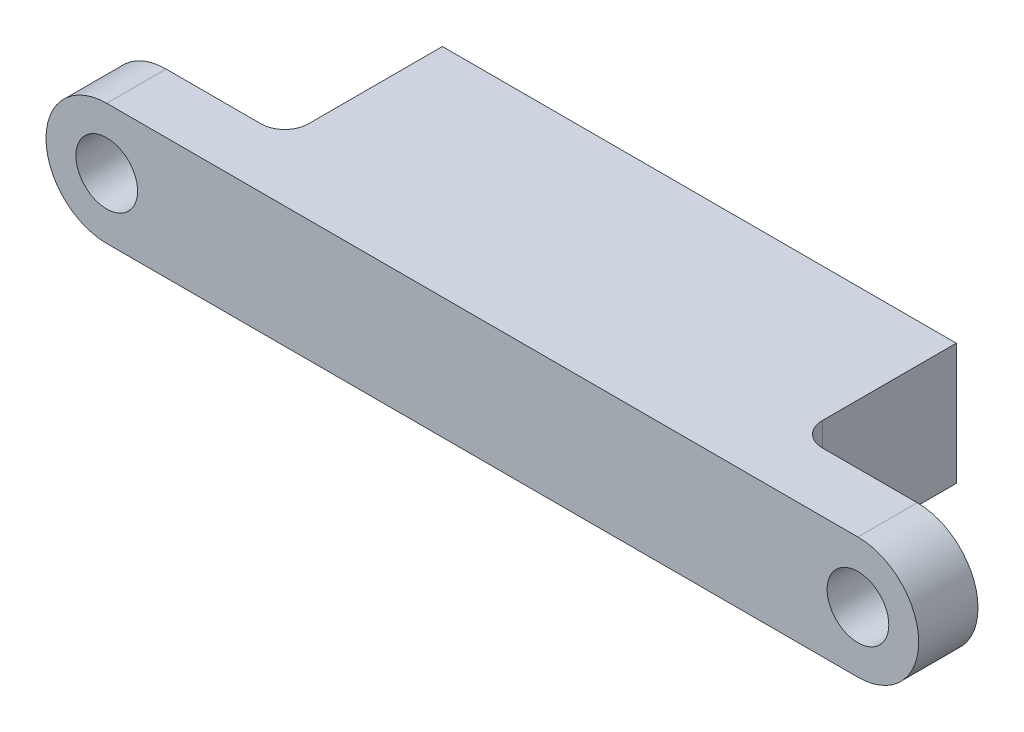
ISO-10303-21;
HEADER;
FILE_DESCRIPTION(('STEP AP214'),'2;1');
FILE_NAME('part.step','',(''),(''),'','','');
FILE_SCHEMA(('AUTOMOTIVE_DESIGN { 1 0 10303 214 1 1 1 1 }'));
ENDSEC;
DATA;
#1=APPLICATION_CONTEXT('core data for automotive mechanical design processes');
#2=APPLICATION_PROTOCOL_DEFINITION('international standard','automotive_design',2000,#1);
#3=PRODUCT_CONTEXT('',#1,'mechanical');
#4=PRODUCT('Part','Part','',(#3));
#5=PRODUCT_RELATED_PRODUCT_CATEGORY('part','',(#4));
#6=PRODUCT_DEFINITION_FORMATION('','',#4);
#7=PRODUCT_DEFINITION_CONTEXT('part definition',#1,'design');
#8=PRODUCT_DEFINITION('design','',#6,#7);
#9=PRODUCT_DEFINITION_SHAPE('','',#8);
#10=(LENGTH_UNIT() NAMED_UNIT(*) SI_UNIT(.MILLI.,.METRE.));
#11=(NAMED_UNIT(*) PLANE_ANGLE_UNIT() SI_UNIT($,.RADIAN.));
#12=(NAMED_UNIT(*) SI_UNIT($,.STERADIAN.) SOLID_ANGLE_UNIT());
#13=UNCERTAINTY_MEASURE_WITH_UNIT(LENGTH_MEASURE(1.E-05),#10,'distance_accuracy_value','');
#14=(GEOMETRIC_REPRESENTATION_CONTEXT(3) GLOBAL_UNCERTAINTY_ASSIGNED_CONTEXT((#13)) GLOBAL_UNIT_ASSIGNED_CONTEXT((#10,
#11,#12)) REPRESENTATION_CONTEXT('',''));
#15=CARTESIAN_POINT('',(0.,0.,0.));
#16=DIRECTION('',(0.,0.,1.));
#17=DIRECTION('',(1.,0.,0.));
#18=AXIS2_PLACEMENT_3D('',#15,#16,#17);
#19=CARTESIAN_POINT('',(483.575693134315,1224.12016125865,1192.24754986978));
#20=DIRECTION('',(0.,0.,1.));
#21=DIRECTION('',(0.,-1.,0.));
#22=AXIS2_PLACEMENT_3D('',#19,#20,#21);
#23=CYLINDRICAL_SURFACE('',#22,2.24999999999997);
#24=CARTESIAN_POINT('',(483.575693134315,1224.12016125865,1248.76303447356));
#25=DIRECTION('',(0.,0.,-1.));
#26=DIRECTION('',(0.,1.,0.));
#27=AXIS2_PLACEMENT_3D('',#24,#25,#26);
#28=CIRCLE('',#27,2.24999999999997);
#29=CARTESIAN_POINT('',(483.575693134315,1226.37016125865,1248.76303447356));
#30=VERTEX_POINT('',#29);
#31=EDGE_CURVE('E181',#30,#30,#28,.T.);
#32=ORIENTED_EDGE('',*,*,#31,.T.);
#33=EDGE_LOOP('',(#32));
#34=FACE_BOUND('',#33,.T.);
#35=CARTESIAN_POINT('',(483.575693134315,1224.12016125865,1248.87403447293));
#36=DIRECTION('',(0.,0.,1.));
#37=DIRECTION('',(1.,0.,0.));
#38=AXIS2_PLACEMENT_3D('',#35,#36,#37);
#39=CIRCLE('',#38,2.24999999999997);
#40=CARTESIAN_POINT('',(485.825693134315,1224.12016125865,1248.87403447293));
#41=VERTEX_POINT('',#40);
#42=EDGE_CURVE('E126',#41,#41,#39,.T.);
#43=ORIENTED_EDGE('',*,*,#42,.T.);
#44=EDGE_LOOP('',(#43));
#45=FACE_BOUND('',#44,.T.);
#46=ADVANCED_FACE('F39',(#34,#45),#23,.F.);
#47=CARTESIAN_POINT('',(441.575693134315,1224.12016125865,1192.24754986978));
#48=DIRECTION('',(0.,0.,1.));
#49=DIRECTION('',(0.,-1.,0.));
#50=AXIS2_PLACEMENT_3D('',#47,#48,#49);
#51=CYLINDRICAL_SURFACE('',#50,2.24999999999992);
#52=CARTESIAN_POINT('',(441.575693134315,1224.12016125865,1248.76303447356));
#53=DIRECTION('',(0.,0.,-1.));
#54=DIRECTION('',(0.,1.,0.));
#55=AXIS2_PLACEMENT_3D('',#52,#53,#54);
#56=CIRCLE('',#55,2.24999999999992);
#57=CARTESIAN_POINT('',(441.575693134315,1226.37016125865,1248.76303447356));
#58=VERTEX_POINT('',#57);
#59=EDGE_CURVE('E157',#58,#58,#56,.T.);
#60=ORIENTED_EDGE('',*,*,#59,.T.);
#61=EDGE_LOOP('',(#60));
#62=FACE_BOUND('',#61,.T.);
#63=CARTESIAN_POINT('',(441.575693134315,1224.12016125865,1248.87403447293));
#64=DIRECTION('',(0.,0.,1.));
#65=DIRECTION('',(1.,0.,0.));
#66=AXIS2_PLACEMENT_3D('',#63,#64,#65);
#67=CIRCLE('',#66,2.24999999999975);
#68=CARTESIAN_POINT('',(443.825693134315,1224.12016125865,1248.87403447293));
#69=VERTEX_POINT('',#68);
#70=EDGE_CURVE('E128',#69,#69,#67,.T.);
#71=ORIENTED_EDGE('',*,*,#70,.T.);
#72=EDGE_LOOP('',(#71));
#73=FACE_BOUND('',#72,.T.);
#74=ADVANCED_FACE('F281',(#62,#73),#51,.F.);
#75=CARTESIAN_POINT('',(490.075693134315,1230.62016125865,1192.24754986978));
#76=DIRECTION('',(0.,-1.,0.));
#77=DIRECTION('',(0.,0.,-1.));
#78=AXIS2_PLACEMENT_3D('',#75,#76,#77);
#79=PLANE('',#78);
#80=DIRECTION('',(1.,0.,0.));
#81=VECTOR('',#80,1.);
#82=CARTESIAN_POINT('',(490.075693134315,1230.62016125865,1248.76303447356));
#83=LINE('',#82,#81);
#84=CARTESIAN_POINT('',(435.075693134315,1230.62016125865,1248.76303447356));
#85=VERTEX_POINT('',#84);
#86=CARTESIAN_POINT('',(490.075693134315,1230.62016125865,1248.76303447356));
#87=VERTEX_POINT('',#86);
#88=EDGE_CURVE('E186',#85,#87,#83,.T.);
#89=ORIENTED_EDGE('',*,*,#88,.F.);
#90=DIRECTION('',(0.,0.,1.));
#91=VECTOR('',#90,1.);
#92=CARTESIAN_POINT('',(435.075693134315,1230.62016125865,1192.24754986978));
#93=LINE('',#92,#91);
#94=CARTESIAN_POINT('',(435.075693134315,1230.62016125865,1263.09803447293));
#95=VERTEX_POINT('',#94);
#96=EDGE_CURVE('E202',#85,#95,#93,.T.);
#97=ORIENTED_EDGE('',*,*,#96,.T.);
#98=CARTESIAN_POINT('',(432.535693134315,1230.62016125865,1263.09803447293));
#99=DIRECTION('',(0.,-1.,0.));
#100=DIRECTION('',(0.,0.,-1.));
#101=AXIS2_PLACEMENT_3D('',#98,#99,#100);
#102=CIRCLE('',#101,2.54);
#103=CARTESIAN_POINT('',(432.535693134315,1230.62016125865,1265.63803447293));
#104=VERTEX_POINT('',#103);
#105=EDGE_CURVE('E48',#95,#104,#102,.T.);
#106=ORIENTED_EDGE('',*,*,#105,.T.);
#107=DIRECTION('',(-1.,0.,0.));
#108=VECTOR('',#107,1.);
#109=CARTESIAN_POINT('',(422.375693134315,1230.62016125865,1265.63803447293));
#110=LINE('',#109,#108);
#111=CARTESIAN_POINT('',(422.375693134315,1230.62016125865,1265.63803447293));
#112=VERTEX_POINT('',#111);
#113=EDGE_CURVE('E148',#104,#112,#110,.T.);
#114=ORIENTED_EDGE('',*,*,#113,.T.);
#115=DIRECTION('',(0.,0.,1.));
#116=VECTOR('',#115,1.);
#117=CARTESIAN_POINT('',(422.375693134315,1230.62016125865,1265.63803447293));
#118=LINE('',#117,#116);
#119=CARTESIAN_POINT('',(422.375693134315,1230.62016125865,1271.98803447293));
#120=VERTEX_POINT('',#119);
#121=EDGE_CURVE('E153',#112,#120,#118,.T.);
#122=ORIENTED_EDGE('',*,*,#121,.T.);
#123=DIRECTION('',(1.,0.,0.));
#124=VECTOR('',#123,1.);
#125=CARTESIAN_POINT('',(490.075693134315,1230.62016125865,1271.98803447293));
#126=LINE('',#125,#124);
#127=CARTESIAN_POINT('',(502.775693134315,1230.62016125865,1271.98803447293));
#128=VERTEX_POINT('',#127);
#129=EDGE_CURVE('E199',#120,#128,#126,.T.);
#130=ORIENTED_EDGE('',*,*,#129,.T.);
#131=DIRECTION('',(0.,0.,1.));
#132=VECTOR('',#131,1.);
#133=CARTESIAN_POINT('',(502.775693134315,1230.62016125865,1265.63803447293));
#134=LINE('',#133,#132);
#135=CARTESIAN_POINT('',(502.775693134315,1230.62016125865,1265.63803447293));
#136=VERTEX_POINT('',#135);
#137=EDGE_CURVE('E165',#136,#128,#134,.T.);
#138=ORIENTED_EDGE('',*,*,#137,.F.);
#139=DIRECTION('',(-1.,0.,0.));
#140=VECTOR('',#139,1.);
#141=CARTESIAN_POINT('',(502.775693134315,1230.62016125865,1265.63803447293));
#142=LINE('',#141,#140);
#143=CARTESIAN_POINT('',(492.615693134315,1230.62016125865,1265.63803447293));
#144=VERTEX_POINT('',#143);
#145=EDGE_CURVE('E173',#136,#144,#142,.T.);
#146=ORIENTED_EDGE('',*,*,#145,.T.);
#147=CARTESIAN_POINT('',(492.615693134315,1230.62016125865,1263.09803447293));
#148=DIRECTION('',(0.,-1.,0.));
#149=DIRECTION('',(0.,0.,-1.));
#150=AXIS2_PLACEMENT_3D('',#147,#148,#149);
#151=CIRCLE('',#150,2.54);
#152=CARTESIAN_POINT('',(490.075693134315,1230.62016125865,1263.09803447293));
#153=VERTEX_POINT('',#152);
#154=EDGE_CURVE('E226',#144,#153,#151,.T.);
#155=ORIENTED_EDGE('',*,*,#154,.T.);
#156=DIRECTION('',(0.,0.,1.));
#157=VECTOR('',#156,1.);
#158=CARTESIAN_POINT('',(490.075693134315,1230.62016125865,1192.24754986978));
#159=LINE('',#158,#157);
#160=EDGE_CURVE('E205',#87,#153,#159,.T.);
#161=ORIENTED_EDGE('',*,*,#160,.F.);
#162=EDGE_LOOP('',(#89,#97,#106,#114,#122,#130,#138,#146,#155,#161));
#163=FACE_BOUND('',#162,.T.);
#164=ADVANCED_FACE('F230',(#163),#79,.F.);
#165=CARTESIAN_POINT('',(435.075693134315,1230.62016125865,1192.24754986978));
#166=DIRECTION('',(1.,0.,0.));
#167=DIRECTION('',(0.,0.,-1.));
#168=AXIS2_PLACEMENT_3D('',#165,#166,#167);
#169=PLANE('',#168);
#170=DIRECTION('',(0.,0.,1.));
#171=VECTOR('',#170,1.);
#172=CARTESIAN_POINT('',(435.075693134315,1217.62016125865,1192.24754986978));
#173=LINE('',#172,#171);
#174=CARTESIAN_POINT('',(435.075693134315,1217.62016125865,1248.76303447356));
#175=VERTEX_POINT('',#174);
#176=CARTESIAN_POINT('',(435.075693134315,1217.62016125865,1263.09803447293));
#177=VERTEX_POINT('',#176);
#178=EDGE_CURVE('E210',#175,#177,#173,.T.);
#179=ORIENTED_EDGE('',*,*,#178,.T.);
#180=DIRECTION('',(0.,1.,0.));
#181=VECTOR('',#180,1.);
#182=CARTESIAN_POINT('',(435.075693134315,1230.62016125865,1263.09803447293));
#183=LINE('',#182,#181);
#184=EDGE_CURVE('E219',#177,#95,#183,.T.);
#185=ORIENTED_EDGE('',*,*,#184,.T.);
#186=ORIENTED_EDGE('',*,*,#96,.F.);
#187=DIRECTION('',(0.,1.,0.));
#188=VECTOR('',#187,1.);
#189=CARTESIAN_POINT('',(435.075693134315,1230.62016125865,1248.76303447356));
#190=LINE('',#189,#188);
#191=EDGE_CURVE('E188',#175,#85,#190,.T.);
#192=ORIENTED_EDGE('',*,*,#191,.F.);
#193=EDGE_LOOP('',(#179,#185,#186,#192));
#194=FACE_BOUND('',#193,.T.);
#195=ADVANCED_FACE('F262',(#194),#169,.F.);
#196=CARTESIAN_POINT('',(490.075693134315,1217.62016125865,1192.24754986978));
#197=DIRECTION('',(0.,1.,0.));
#198=DIRECTION('',(0.,0.,1.));
#199=AXIS2_PLACEMENT_3D('',#196,#197,#198);
#200=PLANE('',#199);
#201=DIRECTION('',(-1.,0.,0.));
#202=VECTOR('',#201,1.);
#203=CARTESIAN_POINT('',(490.075693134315,1217.62016125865,1248.76303447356));
#204=LINE('',#203,#202);
#205=CARTESIAN_POINT('',(490.075693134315,1217.62016125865,1248.76303447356));
#206=VERTEX_POINT('',#205);
#207=EDGE_CURVE('E195',#206,#175,#204,.T.);
#208=ORIENTED_EDGE('',*,*,#207,.F.);
#209=DIRECTION('',(0.,0.,1.));
#210=VECTOR('',#209,1.);
#211=CARTESIAN_POINT('',(490.075693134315,1217.62016125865,1192.24754986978));
#212=LINE('',#211,#210);
#213=CARTESIAN_POINT('',(490.075693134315,1217.62016125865,1263.09803447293));
#214=VERTEX_POINT('',#213);
#215=EDGE_CURVE('E209',#206,#214,#212,.T.);
#216=ORIENTED_EDGE('',*,*,#215,.T.);
#217=CARTESIAN_POINT('',(492.615693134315,1217.62016125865,1263.09803447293));
#218=DIRECTION('',(0.,1.,0.));
#219=DIRECTION('',(0.,0.,1.));
#220=AXIS2_PLACEMENT_3D('',#217,#218,#219);
#221=CIRCLE('',#220,2.54);
#222=CARTESIAN_POINT('',(492.615693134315,1217.62016125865,1265.63803447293));
#223=VERTEX_POINT('',#222);
#224=EDGE_CURVE('E221',#214,#223,#221,.T.);
#225=ORIENTED_EDGE('',*,*,#224,.T.);
#226=DIRECTION('',(1.,0.,0.));
#227=VECTOR('',#226,1.);
#228=CARTESIAN_POINT('',(490.075693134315,1217.62016125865,1265.63803447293));
#229=LINE('',#228,#227);
#230=CARTESIAN_POINT('',(502.775693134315,1217.62016125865,1265.63803447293));
#231=VERTEX_POINT('',#230);
#232=EDGE_CURVE('E164',#223,#231,#229,.T.);
#233=ORIENTED_EDGE('',*,*,#232,.T.);
#234=DIRECTION('',(0.,0.,1.));
#235=VECTOR('',#234,1.);
#236=CARTESIAN_POINT('',(502.775693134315,1217.62016125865,1265.63803447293));
#237=LINE('',#236,#235);
#238=CARTESIAN_POINT('',(502.775693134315,1217.62016125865,1271.98803447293));
#239=VERTEX_POINT('',#238);
#240=EDGE_CURVE('E135',#231,#239,#237,.T.);
#241=ORIENTED_EDGE('',*,*,#240,.T.);
#242=DIRECTION('',(-1.,0.,0.));
#243=VECTOR('',#242,1.);
#244=CARTESIAN_POINT('',(490.075693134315,1217.62016125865,1271.98803447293));
#245=LINE('',#244,#243);
#246=CARTESIAN_POINT('',(422.375693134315,1217.62016125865,1271.98803447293));
#247=VERTEX_POINT('',#246);
#248=EDGE_CURVE('E196',#239,#247,#245,.T.);
#249=ORIENTED_EDGE('',*,*,#248,.T.);
#250=DIRECTION('',(0.,0.,1.));
#251=VECTOR('',#250,1.);
#252=CARTESIAN_POINT('',(422.375693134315,1217.62016125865,1265.63803447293));
#253=LINE('',#252,#251);
#254=CARTESIAN_POINT('',(422.375693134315,1217.62016125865,1265.63803447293));
#255=VERTEX_POINT('',#254);
#256=EDGE_CURVE('E156',#255,#247,#253,.T.);
#257=ORIENTED_EDGE('',*,*,#256,.F.);
#258=DIRECTION('',(1.,0.,0.));
#259=VECTOR('',#258,1.);
#260=CARTESIAN_POINT('',(435.075693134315,1217.62016125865,1265.63803447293));
#261=LINE('',#260,#259);
#262=CARTESIAN_POINT('',(432.535693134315,1217.62016125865,1265.63803447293));
#263=VERTEX_POINT('',#262);
#264=EDGE_CURVE('E151',#255,#263,#261,.T.);
#265=ORIENTED_EDGE('',*,*,#264,.T.);
#266=CARTESIAN_POINT('',(432.535693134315,1217.62016125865,1263.09803447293));
#267=DIRECTION('',(0.,1.,0.));
#268=DIRECTION('',(0.,0.,1.));
#269=AXIS2_PLACEMENT_3D('',#266,#267,#268);
#270=CIRCLE('',#269,2.54);
#271=EDGE_CURVE('E11',#263,#177,#270,.T.);
#272=ORIENTED_EDGE('',*,*,#271,.T.);
#273=ORIENTED_EDGE('',*,*,#178,.F.);
#274=EDGE_LOOP('',(#208,#216,#225,#233,#241,#249,#257,#265,#272,#273));
#275=FACE_BOUND('',#274,.T.);
#276=ADVANCED_FACE('F242',(#275),#200,.F.);
#277=CARTESIAN_POINT('',(490.075693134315,1230.62016125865,1192.24754986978));
#278=DIRECTION('',(-1.,0.,0.));
#279=DIRECTION('',(0.,0.,1.));
#280=AXIS2_PLACEMENT_3D('',#277,#278,#279);
#281=PLANE('',#280);
#282=ORIENTED_EDGE('',*,*,#160,.T.);
#283=DIRECTION('',(0.,-1.,0.));
#284=VECTOR('',#283,1.);
#285=CARTESIAN_POINT('',(490.075693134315,1230.62016125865,1263.09803447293));
#286=LINE('',#285,#284);
#287=EDGE_CURVE('E213',#153,#214,#286,.T.);
#288=ORIENTED_EDGE('',*,*,#287,.T.);
#289=ORIENTED_EDGE('',*,*,#215,.F.);
#290=DIRECTION('',(0.,-1.,0.));
#291=VECTOR('',#290,1.);
#292=CARTESIAN_POINT('',(490.075693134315,1230.62016125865,1248.76303447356));
#293=LINE('',#292,#291);
#294=EDGE_CURVE('E192',#87,#206,#293,.T.);
#295=ORIENTED_EDGE('',*,*,#294,.F.);
#296=EDGE_LOOP('',(#282,#288,#289,#295));
#297=FACE_BOUND('',#296,.T.);
#298=ADVANCED_FACE('F240',(#297),#281,.F.);
#299=CARTESIAN_POINT('',(0.,0.,1271.98803447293));
#300=DIRECTION('',(0.,0.,-1.));
#301=DIRECTION('',(-1.,0.,0.));
#302=AXIS2_PLACEMENT_3D('',#299,#300,#301);
#303=PLANE('',#302);
#304=ORIENTED_EDGE('',*,*,#248,.F.);
#305=CARTESIAN_POINT('',(502.775693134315,1224.12016125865,1271.98803447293));
#306=DIRECTION('',(0.,0.,1.));
#307=DIRECTION('',(-1.,0.,0.));
#308=AXIS2_PLACEMENT_3D('',#305,#306,#307);
#309=CIRCLE('',#308,6.49999999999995);
#310=EDGE_CURVE('E169',#239,#128,#309,.T.);
#311=ORIENTED_EDGE('',*,*,#310,.T.);
#312=ORIENTED_EDGE('',*,*,#129,.F.);
#313=CARTESIAN_POINT('',(422.375693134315,1224.12016125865,1271.98803447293));
#314=DIRECTION('',(0.,0.,1.));
#315=DIRECTION('',(1.,0.,0.));
#316=AXIS2_PLACEMENT_3D('',#313,#314,#315);
#317=CIRCLE('',#316,6.49999999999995);
#318=EDGE_CURVE('E143',#120,#247,#317,.T.);
#319=ORIENTED_EDGE('',*,*,#318,.T.);
#320=EDGE_LOOP('',(#304,#311,#312,#319));
#321=FACE_BOUND('',#320,.T.);
#322=CARTESIAN_POINT('',(502.775693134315,1224.12016125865,1271.98803447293));
#323=DIRECTION('',(0.,0.,1.));
#324=DIRECTION('',(1.,0.,0.));
#325=AXIS2_PLACEMENT_3D('',#322,#323,#324);
#326=CIRCLE('',#325,3.30200000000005);
#327=CARTESIAN_POINT('',(506.077693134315,1224.12016125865,1271.98803447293));
#328=VERTEX_POINT('',#327);
#329=EDGE_CURVE('E144',#328,#328,#326,.T.);
#330=ORIENTED_EDGE('',*,*,#329,.F.);
#331=EDGE_LOOP('',(#330));
#332=FACE_BOUND('',#331,.T.);
#333=CARTESIAN_POINT('',(422.375693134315,1224.12016125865,1271.98803447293));
#334=DIRECTION('',(0.,0.,1.));
#335=DIRECTION('',(1.,0.,0.));
#336=AXIS2_PLACEMENT_3D('',#333,#334,#335);
#337=CIRCLE('',#336,3.30200000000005);
#338=CARTESIAN_POINT('',(425.677693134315,1224.12016125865,1271.98803447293));
#339=VERTEX_POINT('',#338);
#340=EDGE_CURVE('E142',#339,#339,#337,.T.);
#341=ORIENTED_EDGE('',*,*,#340,.F.);
#342=EDGE_LOOP('',(#341));
#343=FACE_BOUND('',#342,.T.);
#344=ADVANCED_FACE('F258',(#321,#332,#343),#303,.F.);
#345=CARTESIAN_POINT('',(573.960693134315,1001.42936125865,1248.76303447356));
#346=DIRECTION('',(0.,0.,-1.));
#347=DIRECTION('',(0.,1.,0.));
#348=AXIS2_PLACEMENT_3D('',#345,#346,#347);
#349=PLANE('',#348);
#350=ORIENTED_EDGE('',*,*,#59,.F.);
#351=EDGE_LOOP('',(#350));
#352=FACE_BOUND('',#351,.T.);
#353=ORIENTED_EDGE('',*,*,#31,.F.);
#354=EDGE_LOOP('',(#353));
#355=FACE_BOUND('',#354,.T.);
#356=ORIENTED_EDGE('',*,*,#88,.T.);
#357=ORIENTED_EDGE('',*,*,#294,.T.);
#358=ORIENTED_EDGE('',*,*,#207,.T.);
#359=ORIENTED_EDGE('',*,*,#191,.T.);
#360=EDGE_LOOP('',(#356,#357,#358,#359));
#361=FACE_BOUND('',#360,.T.);
#362=ADVANCED_FACE('F266',(#352,#355,#361),#349,.T.);
#363=CARTESIAN_POINT('',(502.775693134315,1224.12016125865,1265.63803447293));
#364=DIRECTION('',(0.,0.,1.));
#365=DIRECTION('',(1.,0.,0.));
#366=AXIS2_PLACEMENT_3D('',#363,#364,#365);
#367=CYLINDRICAL_SURFACE('',#366,6.49999999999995);
#368=ORIENTED_EDGE('',*,*,#310,.F.);
#369=ORIENTED_EDGE('',*,*,#240,.F.);
#370=CARTESIAN_POINT('',(502.775693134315,1224.12016125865,1265.63803447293));
#371=DIRECTION('',(0.,0.,1.));
#372=DIRECTION('',(-1.,0.,0.));
#373=AXIS2_PLACEMENT_3D('',#370,#371,#372);
#374=CIRCLE('',#373,6.49999999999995);
#375=EDGE_CURVE('E172',#231,#136,#374,.T.);
#376=ORIENTED_EDGE('',*,*,#375,.T.);
#377=ORIENTED_EDGE('',*,*,#137,.T.);
#378=EDGE_LOOP('',(#368,#369,#376,#377));
#379=FACE_BOUND('',#378,.T.);
#380=ADVANCED_FACE('F249',(#379),#367,.T.);
#381=CARTESIAN_POINT('',(502.775693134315,1224.12016125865,1265.63803447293));
#382=DIRECTION('',(0.,0.,-1.));
#383=DIRECTION('',(-1.,0.,0.));
#384=AXIS2_PLACEMENT_3D('',#381,#382,#383);
#385=PLANE('',#384);
#386=CARTESIAN_POINT('',(502.775693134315,1224.12016125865,1265.63803447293));
#387=DIRECTION('',(0.,0.,1.));
#388=DIRECTION('',(1.,0.,0.));
#389=AXIS2_PLACEMENT_3D('',#386,#387,#388);
#390=CIRCLE('',#389,3.30200000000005);
#391=CARTESIAN_POINT('',(506.077693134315,1224.12016125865,1265.63803447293));
#392=VERTEX_POINT('',#391);
#393=EDGE_CURVE('E171',#392,#392,#390,.T.);
#394=ORIENTED_EDGE('',*,*,#393,.T.);
#395=EDGE_LOOP('',(#394));
#396=FACE_BOUND('',#395,.T.);
#397=ORIENTED_EDGE('',*,*,#232,.F.);
#398=DIRECTION('',(0.,-1.,0.));
#399=VECTOR('',#398,1.);
#400=CARTESIAN_POINT('',(492.615693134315,1224.12016125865,1265.63803447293));
#401=LINE('',#400,#399);
#402=EDGE_CURVE('E217',#223,#144,#401,.F.);
#403=ORIENTED_EDGE('',*,*,#402,.T.);
#404=ORIENTED_EDGE('',*,*,#145,.F.);
#405=ORIENTED_EDGE('',*,*,#375,.F.);
#406=EDGE_LOOP('',(#397,#403,#404,#405));
#407=FACE_BOUND('',#406,.T.);
#408=ADVANCED_FACE('F248',(#396,#407),#385,.T.);
#409=CARTESIAN_POINT('',(502.775693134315,1224.12016125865,1265.63803447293));
#410=DIRECTION('',(0.,0.,1.));
#411=DIRECTION('',(1.,0.,0.));
#412=AXIS2_PLACEMENT_3D('',#409,#410,#411);
#413=CYLINDRICAL_SURFACE('',#412,3.30200000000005);
#414=ORIENTED_EDGE('',*,*,#393,.F.);
#415=EDGE_LOOP('',(#414));
#416=FACE_BOUND('',#415,.T.);
#417=ORIENTED_EDGE('',*,*,#329,.T.);
#418=EDGE_LOOP('',(#417));
#419=FACE_BOUND('',#418,.T.);
#420=ADVANCED_FACE('F316',(#416,#419),#413,.F.);
#421=CARTESIAN_POINT('',(422.375693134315,1224.12016125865,1265.63803447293));
#422=DIRECTION('',(0.,0.,1.));
#423=DIRECTION('',(1.,0.,0.));
#424=AXIS2_PLACEMENT_3D('',#421,#422,#423);
#425=CYLINDRICAL_SURFACE('',#424,6.49999999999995);
#426=ORIENTED_EDGE('',*,*,#318,.F.);
#427=ORIENTED_EDGE('',*,*,#121,.F.);
#428=CARTESIAN_POINT('',(422.375693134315,1224.12016125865,1265.63803447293));
#429=DIRECTION('',(0.,0.,1.));
#430=DIRECTION('',(1.,0.,0.));
#431=AXIS2_PLACEMENT_3D('',#428,#429,#430);
#432=CIRCLE('',#431,6.49999999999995);
#433=EDGE_CURVE('E146',#112,#255,#432,.T.);
#434=ORIENTED_EDGE('',*,*,#433,.T.);
#435=ORIENTED_EDGE('',*,*,#256,.T.);
#436=EDGE_LOOP('',(#426,#427,#434,#435));
#437=FACE_BOUND('',#436,.T.);
#438=ADVANCED_FACE('F251',(#437),#425,.T.);
#439=CARTESIAN_POINT('',(422.375693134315,1224.12016125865,1265.63803447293));
#440=DIRECTION('',(0.,0.,1.));
#441=DIRECTION('',(1.,0.,0.));
#442=AXIS2_PLACEMENT_3D('',#439,#440,#441);
#443=PLANE('',#442);
#444=CARTESIAN_POINT('',(422.375693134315,1224.12016125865,1265.63803447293));
#445=DIRECTION('',(0.,0.,1.));
#446=DIRECTION('',(1.,0.,0.));
#447=AXIS2_PLACEMENT_3D('',#444,#445,#446);
#448=CIRCLE('',#447,3.30200000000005);
#449=CARTESIAN_POINT('',(425.677693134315,1224.12016125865,1265.63803447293));
#450=VERTEX_POINT('',#449);
#451=EDGE_CURVE('E136',#450,#450,#448,.T.);
#452=ORIENTED_EDGE('',*,*,#451,.T.);
#453=EDGE_LOOP('',(#452));
#454=FACE_BOUND('',#453,.T.);
#455=ORIENTED_EDGE('',*,*,#113,.F.);
#456=DIRECTION('',(0.,1.,0.));
#457=VECTOR('',#456,1.);
#458=CARTESIAN_POINT('',(432.535693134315,1217.62016125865,1265.63803447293));
#459=LINE('',#458,#457);
#460=EDGE_CURVE('E54',#104,#263,#459,.F.);
#461=ORIENTED_EDGE('',*,*,#460,.T.);
#462=ORIENTED_EDGE('',*,*,#264,.F.);
#463=ORIENTED_EDGE('',*,*,#433,.F.);
#464=EDGE_LOOP('',(#455,#461,#462,#463));
#465=FACE_BOUND('',#464,.T.);
#466=ADVANCED_FACE('F256',(#454,#465),#443,.F.);
#467=CARTESIAN_POINT('',(422.375693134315,1224.12016125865,1265.63803447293));
#468=DIRECTION('',(0.,0.,1.));
#469=DIRECTION('',(1.,0.,0.));
#470=AXIS2_PLACEMENT_3D('',#467,#468,#469);
#471=CYLINDRICAL_SURFACE('',#470,3.30200000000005);
#472=ORIENTED_EDGE('',*,*,#451,.F.);
#473=EDGE_LOOP('',(#472));
#474=FACE_BOUND('',#473,.T.);
#475=ORIENTED_EDGE('',*,*,#340,.T.);
#476=EDGE_LOOP('',(#475));
#477=FACE_BOUND('',#476,.T.);
#478=ADVANCED_FACE('F299',(#474,#477),#471,.F.);
#479=CARTESIAN_POINT('',(492.615693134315,1230.62016125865,1263.09803447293));
#480=DIRECTION('',(0.,-1.,0.));
#481=DIRECTION('',(0.,0.,-1.));
#482=AXIS2_PLACEMENT_3D('',#479,#480,#481);
#483=CYLINDRICAL_SURFACE('',#482,2.54);
#484=ORIENTED_EDGE('',*,*,#154,.F.);
#485=ORIENTED_EDGE('',*,*,#402,.F.);
#486=ORIENTED_EDGE('',*,*,#224,.F.);
#487=ORIENTED_EDGE('',*,*,#287,.F.);
#488=EDGE_LOOP('',(#484,#485,#486,#487));
#489=FACE_BOUND('',#488,.T.);
#490=ADVANCED_FACE('F239',(#489),#483,.F.);
#491=CARTESIAN_POINT('',(432.535693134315,1230.62016125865,1263.09803447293));
#492=DIRECTION('',(0.,-1.,0.));
#493=DIRECTION('',(0.,0.,-1.));
#494=AXIS2_PLACEMENT_3D('',#491,#492,#493);
#495=CYLINDRICAL_SURFACE('',#494,2.54);
#496=ORIENTED_EDGE('',*,*,#271,.F.);
#497=ORIENTED_EDGE('',*,*,#460,.F.);
#498=ORIENTED_EDGE('',*,*,#105,.F.);
#499=ORIENTED_EDGE('',*,*,#184,.F.);
#500=EDGE_LOOP('',(#496,#497,#498,#499));
#501=FACE_BOUND('',#500,.T.);
#502=ADVANCED_FACE('F41',(#501),#495,.F.);
#503=CARTESIAN_POINT('',(441.575693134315,1224.12016125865,1248.87403447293));
#504=DIRECTION('',(0.,0.,1.));
#505=DIRECTION('',(1.,0.,0.));
#506=AXIS2_PLACEMENT_3D('',#503,#504,#505);
#507=PLANE('',#506);
#508=CARTESIAN_POINT('',(441.575693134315,1224.12016125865,1248.87403447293));
#509=DIRECTION('',(0.,0.,1.));
#510=DIRECTION('',(1.,0.,0.));
#511=AXIS2_PLACEMENT_3D('',#508,#509,#510);
#512=CIRCLE('',#511,2.09267716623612);
#513=CARTESIAN_POINT('',(443.668370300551,1224.12016125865,1248.87403447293));
#514=VERTEX_POINT('',#513);
#515=EDGE_CURVE('E43',#514,#514,#512,.T.);
#516=ORIENTED_EDGE('',*,*,#515,.T.);
#517=EDGE_LOOP('',(#516));
#518=FACE_BOUND('',#517,.T.);
#519=ORIENTED_EDGE('',*,*,#70,.F.);
#520=EDGE_LOOP('',(#519));
#521=FACE_BOUND('',#520,.T.);
#522=ADVANCED_FACE('F305',(#518,#521),#507,.F.);
#523=CARTESIAN_POINT('',(483.575693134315,1224.12016125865,1250.46153447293));
#524=DIRECTION('',(0.,0.,-1.));
#525=DIRECTION('',(-1.,0.,0.));
#526=AXIS2_PLACEMENT_3D('',#523,#524,#525);
#527=CONICAL_SURFACE('',#526,0.,0.956351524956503);
#528=ORIENTED_EDGE('',*,*,#42,.F.);
#529=EDGE_LOOP('',(#528));
#530=FACE_BOUND('',#529,.T.);
#531=CARTESIAN_POINT('',(483.575693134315,1224.12016125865,1250.46153447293));
#532=VERTEX_POINT('',#531);
#533=VERTEX_LOOP('',#532);
#534=FACE_BOUND('',#533,.T.);
#535=ADVANCED_FACE('F121',(#530,#534),#527,.F.);
#536=CARTESIAN_POINT('',(441.575693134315,1224.12016125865,1250.35053447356));
#537=DIRECTION('',(0.,0.,-1.));
#538=DIRECTION('',(-1.,0.,0.));
#539=AXIS2_PLACEMENT_3D('',#536,#537,#538);
#540=CONICAL_SURFACE('',#539,0.,0.95635152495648);
#541=CARTESIAN_POINT('',(441.575693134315,1224.12016125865,1250.35053447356));
#542=VERTEX_POINT('',#541);
#543=VERTEX_LOOP('',#542);
#544=FACE_BOUND('',#543,.T.);
#545=ORIENTED_EDGE('',*,*,#515,.F.);
#546=EDGE_LOOP('',(#545));
#547=FACE_BOUND('',#546,.T.);
#548=ADVANCED_FACE('F120',(#544,#547),#540,.F.);
#549=CLOSED_SHELL('',(#46,#74,#164,#195,#276,#298,#344,#362,#380,#408,#420,#438,#466,#478,#490,
#502,#522,#535,#548));
#550=MANIFOLD_SOLID_BREP('B2',#549);
#551=ADVANCED_BREP_SHAPE_REPRESENTATION('',(#18,#550),#14);
#552=SHAPE_DEFINITION_REPRESENTATION(#9,#551);
ENDSEC;
END-ISO-10303-21;
